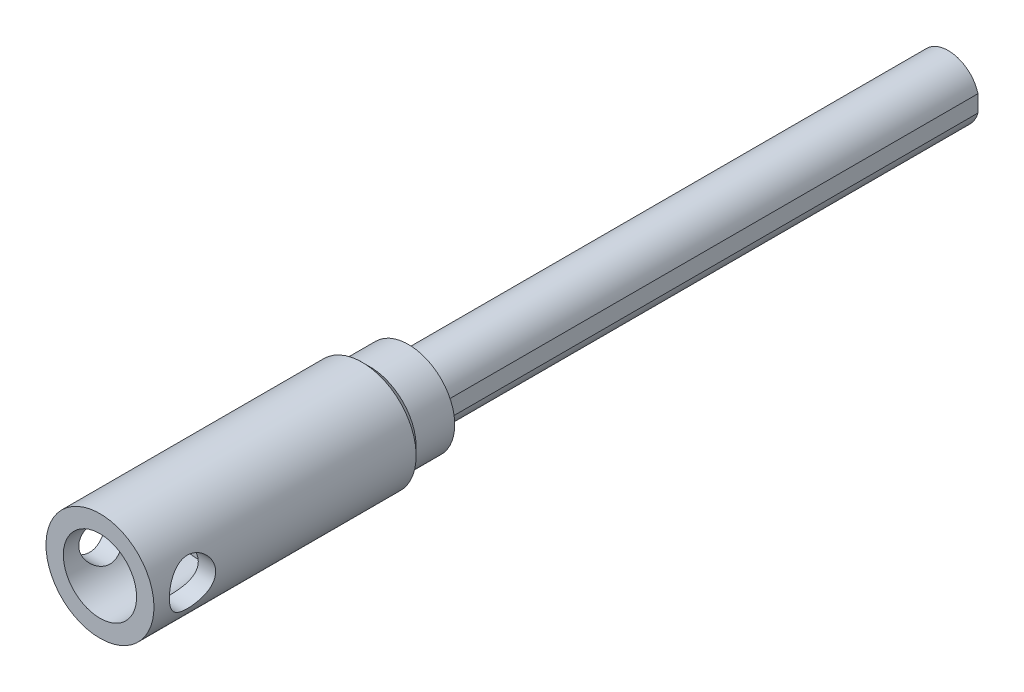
ISO-10303-21;
HEADER;
FILE_DESCRIPTION(('STEP AP214'),'2;1');
FILE_NAME('part.step','',(''),(''),'','','');
FILE_SCHEMA(('AUTOMOTIVE_DESIGN { 1 0 10303 214 1 1 1 1 }'));
ENDSEC;
DATA;
#1=APPLICATION_CONTEXT('core data for automotive mechanical design processes');
#2=APPLICATION_PROTOCOL_DEFINITION('international standard','automotive_design',2000,#1);
#3=PRODUCT_CONTEXT('',#1,'mechanical');
#4=PRODUCT('Part','Part','',(#3));
#5=PRODUCT_RELATED_PRODUCT_CATEGORY('part','',(#4));
#6=PRODUCT_DEFINITION_FORMATION('','',#4);
#7=PRODUCT_DEFINITION_CONTEXT('part definition',#1,'design');
#8=PRODUCT_DEFINITION('design','',#6,#7);
#9=PRODUCT_DEFINITION_SHAPE('','',#8);
#10=(LENGTH_UNIT() NAMED_UNIT(*) SI_UNIT(.MILLI.,.METRE.));
#11=(NAMED_UNIT(*) PLANE_ANGLE_UNIT() SI_UNIT($,.RADIAN.));
#12=(NAMED_UNIT(*) SI_UNIT($,.STERADIAN.) SOLID_ANGLE_UNIT());
#13=UNCERTAINTY_MEASURE_WITH_UNIT(LENGTH_MEASURE(1.E-05),#10,'distance_accuracy_value','');
#14=(GEOMETRIC_REPRESENTATION_CONTEXT(3) GLOBAL_UNCERTAINTY_ASSIGNED_CONTEXT((#13)) GLOBAL_UNIT_ASSIGNED_CONTEXT((#10,
#11,#12)) REPRESENTATION_CONTEXT('',''));
#15=CARTESIAN_POINT('',(0.,0.,0.));
#16=DIRECTION('',(0.,0.,1.));
#17=DIRECTION('',(1.,0.,0.));
#18=AXIS2_PLACEMENT_3D('',#15,#16,#17);
#19=CARTESIAN_POINT('',(2.3094010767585,0.,95.));
#20=DIRECTION('',(-0.866025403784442,0.5,0.));
#21=DIRECTION('',(-0.5,-0.866025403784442,0.));
#22=AXIS2_PLACEMENT_3D('',#19,#20,#21);
#23=PLANE('',#22);
#24=DIRECTION('',(0.,0.,1.));
#25=VECTOR('',#24,1.);
#26=CARTESIAN_POINT('',(1.15470053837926,-2.,95.));
#27=LINE('',#26,#25);
#28=CARTESIAN_POINT('',(1.15470053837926,-2.,95.));
#29=VERTEX_POINT('',#28);
#30=CARTESIAN_POINT('',(1.15470053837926,-2.,97.5));
#31=VERTEX_POINT('',#30);
#32=EDGE_CURVE('E273',#29,#31,#27,.T.);
#33=ORIENTED_EDGE('',*,*,#32,.T.);
#34=DIRECTION('',(-0.5,-0.866025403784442,0.));
#35=VECTOR('',#34,1.);
#36=CARTESIAN_POINT('',(2.3094010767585,0.,97.5));
#37=LINE('',#36,#35);
#38=CARTESIAN_POINT('',(2.3094010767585,0.,97.5));
#39=VERTEX_POINT('',#38);
#40=EDGE_CURVE('E29',#39,#31,#37,.T.);
#41=ORIENTED_EDGE('',*,*,#40,.F.);
#42=DIRECTION('',(0.,0.,1.));
#43=VECTOR('',#42,1.);
#44=CARTESIAN_POINT('',(2.3094010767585,0.,95.));
#45=LINE('',#44,#43);
#46=CARTESIAN_POINT('',(2.3094010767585,0.,95.));
#47=VERTEX_POINT('',#46);
#48=EDGE_CURVE('E33',#47,#39,#45,.T.);
#49=ORIENTED_EDGE('',*,*,#48,.F.);
#50=DIRECTION('',(-0.5,-0.866025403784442,0.));
#51=VECTOR('',#50,1.);
#52=CARTESIAN_POINT('',(2.3094010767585,0.,95.));
#53=LINE('',#52,#51);
#54=EDGE_CURVE('E234',#47,#29,#53,.T.);
#55=ORIENTED_EDGE('',*,*,#54,.T.);
#56=EDGE_LOOP('',(#33,#41,#49,#55));
#57=FACE_BOUND('',#56,.T.);
#58=ADVANCED_FACE('F14',(#57),#23,.T.);
#59=CARTESIAN_POINT('',(-1.15470053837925,-2.,95.));
#60=DIRECTION('',(0.,-1.,0.));
#61=DIRECTION('',(0.,0.,-1.));
#62=AXIS2_PLACEMENT_3D('',#59,#60,#61);
#63=PLANE('',#62);
#64=DIRECTION('',(0.,0.,1.));
#65=VECTOR('',#64,1.);
#66=CARTESIAN_POINT('',(-1.15470053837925,-2.,95.));
#67=LINE('',#66,#65);
#68=CARTESIAN_POINT('',(-1.15470053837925,-2.,95.));
#69=VERTEX_POINT('',#68);
#70=CARTESIAN_POINT('',(-1.15470053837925,-2.,97.5));
#71=VERTEX_POINT('',#70);
#72=EDGE_CURVE('E271',#69,#71,#67,.T.);
#73=ORIENTED_EDGE('',*,*,#72,.T.);
#74=DIRECTION('',(1.,0.,0.));
#75=VECTOR('',#74,1.);
#76=CARTESIAN_POINT('',(-1.15470053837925,-2.,97.5));
#77=LINE('',#76,#75);
#78=EDGE_CURVE('E244',#71,#31,#77,.T.);
#79=ORIENTED_EDGE('',*,*,#78,.T.);
#80=ORIENTED_EDGE('',*,*,#32,.F.);
#81=DIRECTION('',(1.,0.,0.));
#82=VECTOR('',#81,1.);
#83=CARTESIAN_POINT('',(-1.15470053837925,-2.,95.));
#84=LINE('',#83,#82);
#85=EDGE_CURVE('E260',#69,#29,#84,.T.);
#86=ORIENTED_EDGE('',*,*,#85,.F.);
#87=EDGE_LOOP('',(#73,#79,#80,#86));
#88=FACE_BOUND('',#87,.T.);
#89=ADVANCED_FACE('F164',(#88),#63,.F.);
#90=CARTESIAN_POINT('',(-2.3094010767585,0.,95.));
#91=DIRECTION('',(-0.866025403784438,-0.5,0.));
#92=DIRECTION('',(0.5,-0.866025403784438,0.));
#93=AXIS2_PLACEMENT_3D('',#90,#91,#92);
#94=PLANE('',#93);
#95=DIRECTION('',(0.,0.,1.));
#96=VECTOR('',#95,1.);
#97=CARTESIAN_POINT('',(-2.3094010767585,0.,95.));
#98=LINE('',#97,#96);
#99=CARTESIAN_POINT('',(-2.3094010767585,0.,95.));
#100=VERTEX_POINT('',#99);
#101=CARTESIAN_POINT('',(-2.3094010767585,0.,97.5));
#102=VERTEX_POINT('',#101);
#103=EDGE_CURVE('E269',#100,#102,#98,.T.);
#104=ORIENTED_EDGE('',*,*,#103,.T.);
#105=DIRECTION('',(0.5,-0.866025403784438,0.));
#106=VECTOR('',#105,1.);
#107=CARTESIAN_POINT('',(-2.3094010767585,0.,97.5));
#108=LINE('',#107,#106);
#109=EDGE_CURVE('E241',#102,#71,#108,.T.);
#110=ORIENTED_EDGE('',*,*,#109,.T.);
#111=ORIENTED_EDGE('',*,*,#72,.F.);
#112=DIRECTION('',(0.5,-0.866025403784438,0.));
#113=VECTOR('',#112,1.);
#114=CARTESIAN_POINT('',(-2.3094010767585,0.,95.));
#115=LINE('',#114,#113);
#116=EDGE_CURVE('E257',#100,#69,#115,.T.);
#117=ORIENTED_EDGE('',*,*,#116,.F.);
#118=EDGE_LOOP('',(#104,#110,#111,#117));
#119=FACE_BOUND('',#118,.T.);
#120=ADVANCED_FACE('F169',(#119),#94,.F.);
#121=CARTESIAN_POINT('',(-2.3094010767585,0.,95.));
#122=DIRECTION('',(0.866025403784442,-0.5,0.));
#123=DIRECTION('',(0.5,0.866025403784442,0.));
#124=AXIS2_PLACEMENT_3D('',#121,#122,#123);
#125=PLANE('',#124);
#126=DIRECTION('',(0.,0.,1.));
#127=VECTOR('',#126,1.);
#128=CARTESIAN_POINT('',(-1.15470053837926,2.,95.));
#129=LINE('',#128,#127);
#130=CARTESIAN_POINT('',(-1.15470053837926,2.,95.));
#131=VERTEX_POINT('',#130);
#132=CARTESIAN_POINT('',(-1.15470053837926,2.,97.5));
#133=VERTEX_POINT('',#132);
#134=EDGE_CURVE('E267',#131,#133,#129,.T.);
#135=ORIENTED_EDGE('',*,*,#134,.T.);
#136=DIRECTION('',(0.5,0.866025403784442,0.));
#137=VECTOR('',#136,1.);
#138=CARTESIAN_POINT('',(-2.3094010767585,0.,97.5));
#139=LINE('',#138,#137);
#140=EDGE_CURVE('E238',#102,#133,#139,.T.);
#141=ORIENTED_EDGE('',*,*,#140,.F.);
#142=ORIENTED_EDGE('',*,*,#103,.F.);
#143=DIRECTION('',(0.5,0.866025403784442,0.));
#144=VECTOR('',#143,1.);
#145=CARTESIAN_POINT('',(-2.3094010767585,0.,95.));
#146=LINE('',#145,#144);
#147=EDGE_CURVE('E254',#100,#131,#146,.T.);
#148=ORIENTED_EDGE('',*,*,#147,.T.);
#149=EDGE_LOOP('',(#135,#141,#142,#148));
#150=FACE_BOUND('',#149,.T.);
#151=ADVANCED_FACE('F183',(#150),#125,.T.);
#152=CARTESIAN_POINT('',(1.15470053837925,2.,95.));
#153=DIRECTION('',(0.,1.,0.));
#154=DIRECTION('',(-1.,0.,0.));
#155=AXIS2_PLACEMENT_3D('',#152,#153,#154);
#156=PLANE('',#155);
#157=DIRECTION('',(0.,0.,1.));
#158=VECTOR('',#157,1.);
#159=CARTESIAN_POINT('',(1.15470053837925,2.,95.));
#160=LINE('',#159,#158);
#161=CARTESIAN_POINT('',(1.15470053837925,2.,95.));
#162=VERTEX_POINT('',#161);
#163=CARTESIAN_POINT('',(1.15470053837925,2.,97.5));
#164=VERTEX_POINT('',#163);
#165=EDGE_CURVE('E265',#162,#164,#160,.T.);
#166=ORIENTED_EDGE('',*,*,#165,.T.);
#167=DIRECTION('',(-1.,0.,0.));
#168=VECTOR('',#167,1.);
#169=CARTESIAN_POINT('',(1.15470053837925,2.,97.5));
#170=LINE('',#169,#168);
#171=EDGE_CURVE('E235',#164,#133,#170,.T.);
#172=ORIENTED_EDGE('',*,*,#171,.T.);
#173=ORIENTED_EDGE('',*,*,#134,.F.);
#174=DIRECTION('',(-1.,0.,0.));
#175=VECTOR('',#174,1.);
#176=CARTESIAN_POINT('',(1.15470053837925,2.,95.));
#177=LINE('',#176,#175);
#178=EDGE_CURVE('E251',#162,#131,#177,.T.);
#179=ORIENTED_EDGE('',*,*,#178,.F.);
#180=EDGE_LOOP('',(#166,#172,#173,#179));
#181=FACE_BOUND('',#180,.T.);
#182=ADVANCED_FACE('F179',(#181),#156,.F.);
#183=CARTESIAN_POINT('',(2.3094010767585,0.,95.));
#184=DIRECTION('',(0.866025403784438,0.5,0.));
#185=DIRECTION('',(-0.5,0.866025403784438,0.));
#186=AXIS2_PLACEMENT_3D('',#183,#184,#185);
#187=PLANE('',#186);
#188=DIRECTION('',(-0.5,0.866025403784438,0.));
#189=VECTOR('',#188,1.);
#190=CARTESIAN_POINT('',(2.3094010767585,0.,95.));
#191=LINE('',#190,#189);
#192=EDGE_CURVE('E248',#47,#162,#191,.T.);
#193=ORIENTED_EDGE('',*,*,#192,.F.);
#194=ORIENTED_EDGE('',*,*,#48,.T.);
#195=DIRECTION('',(-0.5,0.866025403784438,0.));
#196=VECTOR('',#195,1.);
#197=CARTESIAN_POINT('',(2.3094010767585,0.,97.5));
#198=LINE('',#197,#196);
#199=EDGE_CURVE('E231',#39,#164,#198,.T.);
#200=ORIENTED_EDGE('',*,*,#199,.T.);
#201=ORIENTED_EDGE('',*,*,#165,.F.);
#202=EDGE_LOOP('',(#193,#194,#200,#201));
#203=FACE_BOUND('',#202,.T.);
#204=ADVANCED_FACE('F176',(#203),#187,.F.);
#205=CARTESIAN_POINT('',(3.46410161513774,2.,95.));
#206=DIRECTION('',(0.,0.,-1.));
#207=DIRECTION('',(0.,1.,0.));
#208=AXIS2_PLACEMENT_3D('',#205,#206,#207);
#209=PLANE('',#208);
#210=ORIENTED_EDGE('',*,*,#54,.F.);
#211=ORIENTED_EDGE('',*,*,#192,.T.);
#212=ORIENTED_EDGE('',*,*,#178,.T.);
#213=ORIENTED_EDGE('',*,*,#147,.F.);
#214=ORIENTED_EDGE('',*,*,#116,.T.);
#215=ORIENTED_EDGE('',*,*,#85,.T.);
#216=EDGE_LOOP('',(#210,#211,#212,#213,#214,#215));
#217=FACE_BOUND('',#216,.T.);
#218=ADVANCED_FACE('F174',(#217),#209,.F.);
#219=CARTESIAN_POINT('',(0.,0.,97.5));
#220=DIRECTION('',(0.,0.,1.));
#221=DIRECTION('',(0.,-1.,0.));
#222=AXIS2_PLACEMENT_3D('',#219,#220,#221);
#223=PLANE('',#222);
#224=CARTESIAN_POINT('',(0.,0.,97.5));
#225=DIRECTION('',(0.,0.,1.));
#226=DIRECTION('',(0.,-1.,0.));
#227=AXIS2_PLACEMENT_3D('',#224,#225,#226);
#228=CIRCLE('',#227,4.25);
#229=CARTESIAN_POINT('',(0.,-4.25,97.5));
#230=VERTEX_POINT('',#229);
#231=EDGE_CURVE('E9',#230,#230,#228,.T.);
#232=ORIENTED_EDGE('',*,*,#231,.T.);
#233=EDGE_LOOP('',(#232));
#234=FACE_BOUND('',#233,.T.);
#235=ORIENTED_EDGE('',*,*,#199,.F.);
#236=ORIENTED_EDGE('',*,*,#40,.T.);
#237=ORIENTED_EDGE('',*,*,#78,.F.);
#238=ORIENTED_EDGE('',*,*,#109,.F.);
#239=ORIENTED_EDGE('',*,*,#140,.T.);
#240=ORIENTED_EDGE('',*,*,#171,.F.);
#241=EDGE_LOOP('',(#235,#236,#237,#238,#239,#240));
#242=FACE_BOUND('',#241,.T.);
#243=ADVANCED_FACE('F16',(#234,#242),#223,.T.);
#244=CARTESIAN_POINT('',(0.,0.,92.5));
#245=DIRECTION('',(0.,0.,1.));
#246=DIRECTION('',(0.,-1.,0.));
#247=AXIS2_PLACEMENT_3D('',#244,#245,#246);
#248=CYLINDRICAL_SURFACE('',#247,4.25);
#249=CARTESIAN_POINT('',(0.,0.,92.5));
#250=DIRECTION('',(0.,0.,1.));
#251=DIRECTION('',(0.,-1.,0.));
#252=AXIS2_PLACEMENT_3D('',#249,#250,#251);
#253=CIRCLE('',#252,4.25);
#254=CARTESIAN_POINT('',(0.,-4.25,92.5));
#255=VERTEX_POINT('',#254);
#256=EDGE_CURVE('E22',#255,#255,#253,.T.);
#257=ORIENTED_EDGE('',*,*,#256,.T.);
#258=EDGE_LOOP('',(#257));
#259=FACE_BOUND('',#258,.T.);
#260=ORIENTED_EDGE('',*,*,#231,.F.);
#261=EDGE_LOOP('',(#260));
#262=FACE_BOUND('',#261,.T.);
#263=ADVANCED_FACE('F190',(#259,#262),#248,.T.);
#264=CARTESIAN_POINT('',(0.,0.,0.));
#265=DIRECTION('',(0.,0.,1.));
#266=DIRECTION('',(-1.,0.,0.));
#267=AXIS2_PLACEMENT_3D('',#264,#265,#266);
#268=PLANE('',#267);
#269=DIRECTION('',(0.,-1.,0.));
#270=VECTOR('',#269,1.);
#271=CARTESIAN_POINT('',(3.85,-1.08512672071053,0.));
#272=LINE('',#271,#270);
#273=CARTESIAN_POINT('',(3.85,1.08512672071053,0.));
#274=VERTEX_POINT('',#273);
#275=CARTESIAN_POINT('',(3.85,-1.08512672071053,0.));
#276=VERTEX_POINT('',#275);
#277=EDGE_CURVE('E91',#274,#276,#272,.T.);
#278=ORIENTED_EDGE('',*,*,#277,.T.);
#279=CARTESIAN_POINT('',(0.,0.,0.));
#280=DIRECTION('',(0.,0.,1.));
#281=DIRECTION('',(-1.,0.,0.));
#282=AXIS2_PLACEMENT_3D('',#279,#280,#281);
#283=CIRCLE('',#282,4.);
#284=EDGE_CURVE('E83',#274,#276,#283,.T.);
#285=ORIENTED_EDGE('',*,*,#284,.F.);
#286=EDGE_LOOP('',(#278,#285));
#287=FACE_BOUND('',#286,.T.);
#288=ADVANCED_FACE('F95',(#287),#268,.F.);
#289=CARTESIAN_POINT('',(3.85,-1.08512672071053,80.));
#290=DIRECTION('',(1.,0.,0.));
#291=DIRECTION('',(0.,0.,1.));
#292=AXIS2_PLACEMENT_3D('',#289,#290,#291);
#293=PLANE('',#292);
#294=DIRECTION('',(0.,1.,0.));
#295=VECTOR('',#294,1.);
#296=CARTESIAN_POINT('',(3.85,5.9999999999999,70.));
#297=LINE('',#296,#295);
#298=CARTESIAN_POINT('',(3.85,-1.08512672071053,70.));
#299=VERTEX_POINT('',#298);
#300=CARTESIAN_POINT('',(3.85,1.08512672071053,70.));
#301=VERTEX_POINT('',#300);
#302=EDGE_CURVE('E226',#299,#301,#297,.T.);
#303=ORIENTED_EDGE('',*,*,#302,.F.);
#304=DIRECTION('',(0.,0.,-1.));
#305=VECTOR('',#304,1.);
#306=CARTESIAN_POINT('',(3.85,-1.08512672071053,80.));
#307=LINE('',#306,#305);
#308=EDGE_CURVE('E88',#299,#276,#307,.T.);
#309=ORIENTED_EDGE('',*,*,#308,.T.);
#310=ORIENTED_EDGE('',*,*,#277,.F.);
#311=DIRECTION('',(0.,0.,-1.));
#312=VECTOR('',#311,1.);
#313=CARTESIAN_POINT('',(3.85,1.08512672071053,80.));
#314=LINE('',#313,#312);
#315=EDGE_CURVE('E78',#301,#274,#314,.T.);
#316=ORIENTED_EDGE('',*,*,#315,.F.);
#317=EDGE_LOOP('',(#303,#309,#310,#316));
#318=FACE_BOUND('',#317,.T.);
#319=ADVANCED_FACE('F92',(#318),#293,.T.);
#320=CARTESIAN_POINT('',(0.,0.,80.));
#321=DIRECTION('',(0.,0.,-1.));
#322=DIRECTION('',(1.,0.,0.));
#323=AXIS2_PLACEMENT_3D('',#320,#321,#322);
#324=CYLINDRICAL_SURFACE('',#323,4.);
#325=ORIENTED_EDGE('',*,*,#308,.F.);
#326=CARTESIAN_POINT('',(0.,0.,70.));
#327=DIRECTION('',(0.,0.,1.));
#328=DIRECTION('',(-6.15310496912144E-10,1.,0.));
#329=AXIS2_PLACEMENT_3D('',#326,#327,#328);
#330=CIRCLE('',#329,4.);
#331=EDGE_CURVE('E84',#299,#301,#330,.F.);
#332=ORIENTED_EDGE('',*,*,#331,.T.);
#333=ORIENTED_EDGE('',*,*,#315,.T.);
#334=ORIENTED_EDGE('',*,*,#284,.T.);
#335=EDGE_LOOP('',(#325,#332,#333,#334));
#336=FACE_BOUND('',#335,.T.);
#337=ADVANCED_FACE('F81',(#336),#324,.T.);
#338=CARTESIAN_POINT('',(0.,5.99999999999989,70.));
#339=DIRECTION('',(0.,0.,1.));
#340=DIRECTION('',(0.,-1.,0.));
#341=AXIS2_PLACEMENT_3D('',#338,#339,#340);
#342=PLANE('',#341);
#343=CARTESIAN_POINT('',(0.,0.,70.));
#344=DIRECTION('',(0.,0.,1.));
#345=DIRECTION('',(0.,-1.,0.));
#346=AXIS2_PLACEMENT_3D('',#343,#344,#345);
#347=CIRCLE('',#346,5.99999999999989);
#348=CARTESIAN_POINT('',(0.,-5.99999999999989,70.));
#349=VERTEX_POINT('',#348);
#350=EDGE_CURVE('E221',#349,#349,#347,.T.);
#351=ORIENTED_EDGE('',*,*,#350,.F.);
#352=EDGE_LOOP('',(#351));
#353=FACE_BOUND('',#352,.T.);
#354=ORIENTED_EDGE('',*,*,#331,.F.);
#355=ORIENTED_EDGE('',*,*,#302,.T.);
#356=EDGE_LOOP('',(#354,#355));
#357=FACE_BOUND('',#356,.T.);
#358=ADVANCED_FACE('F327',(#353,#357),#342,.F.);
#359=CARTESIAN_POINT('',(0.,0.,112.759686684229));
#360=DIRECTION('',(0.,0.,1.));
#361=DIRECTION('',(0.,-1.,0.));
#362=AXIS2_PLACEMENT_3D('',#359,#360,#361);
#363=CYLINDRICAL_SURFACE('',#362,5.99999999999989);
#364=CARTESIAN_POINT('',(0.,0.,75.));
#365=DIRECTION('',(0.,0.,1.));
#366=DIRECTION('',(0.,-1.,0.));
#367=AXIS2_PLACEMENT_3D('',#364,#365,#366);
#368=CIRCLE('',#367,5.99999999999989);
#369=CARTESIAN_POINT('',(0.,-5.99999999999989,75.));
#370=VERTEX_POINT('',#369);
#371=EDGE_CURVE('E219',#370,#370,#368,.T.);
#372=ORIENTED_EDGE('',*,*,#371,.F.);
#373=EDGE_LOOP('',(#372));
#374=FACE_BOUND('',#373,.T.);
#375=ORIENTED_EDGE('',*,*,#350,.T.);
#376=EDGE_LOOP('',(#375));
#377=FACE_BOUND('',#376,.T.);
#378=ADVANCED_FACE('F335',(#374,#377),#363,.T.);
#379=CARTESIAN_POINT('',(0.,0.,76.));
#380=DIRECTION('',(0.,0.,1.));
#381=DIRECTION('',(0.,-1.,0.));
#382=AXIS2_PLACEMENT_3D('',#379,#380,#381);
#383=CONICAL_SURFACE('',#382,7.0000000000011,0.78539816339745);
#384=ORIENTED_EDGE('',*,*,#371,.T.);
#385=EDGE_LOOP('',(#384));
#386=FACE_BOUND('',#385,.T.);
#387=CARTESIAN_POINT('',(0.,0.,76.));
#388=DIRECTION('',(0.,0.,1.));
#389=DIRECTION('',(0.,-1.,0.));
#390=AXIS2_PLACEMENT_3D('',#387,#388,#389);
#391=CIRCLE('',#390,7.0000000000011);
#392=CARTESIAN_POINT('',(0.,-7.0000000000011,76.));
#393=VERTEX_POINT('',#392);
#394=EDGE_CURVE('E145',#393,#393,#391,.T.);
#395=ORIENTED_EDGE('',*,*,#394,.F.);
#396=EDGE_LOOP('',(#395));
#397=FACE_BOUND('',#396,.T.);
#398=ADVANCED_FACE('F128',(#386,#397),#383,.T.);
#399=CARTESIAN_POINT('',(0.,0.,112.759686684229));
#400=DIRECTION('',(0.,0.,1.));
#401=DIRECTION('',(0.,-1.,0.));
#402=AXIS2_PLACEMENT_3D('',#399,#400,#401);
#403=CYLINDRICAL_SURFACE('',#402,7.0000000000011);
#404=ORIENTED_EDGE('',*,*,#394,.T.);
#405=EDGE_LOOP('',(#404));
#406=FACE_BOUND('',#405,.T.);
#407=CARTESIAN_POINT('',(-7.0000000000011,1.09818090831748E-12,108.));
#408=CARTESIAN_POINT('',(-6.99999408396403,-0.160281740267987,107.999992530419));
#409=CARTESIAN_POINT('',(-6.9944325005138,-0.320833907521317,107.987078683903));
#410=CARTESIAN_POINT('',(-6.97273920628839,-0.637349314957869,107.935917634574));
#411=CARTESIAN_POINT('',(-6.95658080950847,-0.793299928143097,107.897606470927));
#412=CARTESIAN_POINT('',(-6.91541630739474,-1.09553470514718,107.797330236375));
#413=CARTESIAN_POINT('',(-6.89044089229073,-1.24185033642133,107.735447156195));
#414=CARTESIAN_POINT('',(-6.83405660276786,-1.52187332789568,107.590135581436));
#415=CARTESIAN_POINT('',(-6.80264947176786,-1.65558409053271,107.506712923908));
#416=CARTESIAN_POINT('',(-6.73467821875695,-1.91384144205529,107.316072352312));
#417=CARTESIAN_POINT('',(-6.6979389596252,-2.03764045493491,107.207904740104));
#418=CARTESIAN_POINT('',(-6.62417654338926,-2.26599040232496,106.972856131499));
#419=CARTESIAN_POINT('',(-6.58715324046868,-2.37053065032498,106.845964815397));
#420=CARTESIAN_POINT('',(-6.51482055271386,-2.56285686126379,106.568967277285));
#421=CARTESIAN_POINT('',(-6.4797046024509,-2.64946811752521,106.417989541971));
#422=CARTESIAN_POINT('',(-6.41796168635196,-2.79573199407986,106.101890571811));
#423=CARTESIAN_POINT('',(-6.39133010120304,-2.85539929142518,105.936777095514));
#424=CARTESIAN_POINT('',(-6.35147799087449,-2.94294919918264,105.605699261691));
#425=CARTESIAN_POINT('',(-6.33765221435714,-2.97227494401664,105.440192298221));
#426=CARTESIAN_POINT('',(-6.32324849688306,-3.00280607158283,105.10607403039));
#427=CARTESIAN_POINT('',(-6.32266262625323,-3.00402828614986,104.937464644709));
#428=CARTESIAN_POINT('',(-6.33429573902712,-2.97939999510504,104.616700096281));
#429=CARTESIAN_POINT('',(-6.3454687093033,-2.95576113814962,104.464329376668));
#430=CARTESIAN_POINT('',(-6.37758411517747,-2.88580772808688,104.165972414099));
#431=CARTESIAN_POINT('',(-6.39852855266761,-2.83948852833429,104.019987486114));
#432=CARTESIAN_POINT('',(-6.44830685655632,-2.72457659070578,103.734752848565));
#433=CARTESIAN_POINT('',(-6.47730295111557,-2.65551974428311,103.595719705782));
#434=CARTESIAN_POINT('',(-6.53988493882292,-2.49742304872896,103.33065367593));
#435=CARTESIAN_POINT('',(-6.57347269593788,-2.40837507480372,103.20462610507));
#436=CARTESIAN_POINT('',(-6.64512404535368,-2.2034340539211,102.957222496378));
#437=CARTESIAN_POINT('',(-6.68331855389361,-2.08584728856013,102.837283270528));
#438=CARTESIAN_POINT('',(-6.7573460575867,-1.83187332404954,102.618328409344));
#439=CARTESIAN_POINT('',(-6.79317843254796,-1.69548121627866,102.519318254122));
#440=CARTESIAN_POINT('',(-6.85959693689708,-1.40318582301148,102.342756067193));
#441=CARTESIAN_POINT('',(-6.89002455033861,-1.24687114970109,102.265820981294));
#442=CARTESIAN_POINT('',(-6.94097396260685,-0.921879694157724,102.139849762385));
#443=CARTESIAN_POINT('',(-6.96150156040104,-0.753210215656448,102.090797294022));
#444=CARTESIAN_POINT('',(-6.98923526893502,-0.420276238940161,102.025066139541));
#445=CARTESIAN_POINT('',(-6.99723249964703,-0.256457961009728,102.006461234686));
#446=CARTESIAN_POINT('',(-7.00155416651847,0.0721433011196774,101.996370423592));
#447=CARTESIAN_POINT('',(-6.99788220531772,0.236925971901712,102.004876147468));
#448=CARTESIAN_POINT('',(-6.97978676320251,0.553542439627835,102.047415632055));
#449=CARTESIAN_POINT('',(-6.96594519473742,0.7055989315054,102.080068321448));
#450=CARTESIAN_POINT('',(-6.92953888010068,1.0018911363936,102.168020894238));
#451=CARTESIAN_POINT('',(-6.90697304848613,1.14612587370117,102.223323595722));
#452=CARTESIAN_POINT('',(-6.85438751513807,1.42777696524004,102.356801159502));
#453=CARTESIAN_POINT('',(-6.8241570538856,1.56483974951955,102.435636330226));
#454=CARTESIAN_POINT('',(-6.7594298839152,1.82428490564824,102.613218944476));
#455=CARTESIAN_POINT('',(-6.72493135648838,1.9466609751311,102.711974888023));
#456=CARTESIAN_POINT('',(-6.6521478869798,2.18296759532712,102.935289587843));
#457=CARTESIAN_POINT('',(-6.61377354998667,2.29556617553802,103.061232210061));
#458=CARTESIAN_POINT('',(-6.53984037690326,2.49843431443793,103.330782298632));
#459=CARTESIAN_POINT('',(-6.50428232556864,2.58869766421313,103.474394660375));
#460=CARTESIAN_POINT('',(-6.43962969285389,2.74563875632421,103.778813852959));
#461=CARTESIAN_POINT('',(-6.41066255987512,2.8118641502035,103.93988300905));
#462=CARTESIAN_POINT('',(-6.36413607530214,2.91565885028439,104.27252632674));
#463=CARTESIAN_POINT('',(-6.34656658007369,2.95325364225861,104.444090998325));
#464=CARTESIAN_POINT('',(-6.32643481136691,2.9961194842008,104.777991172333));
#465=CARTESIAN_POINT('',(-6.3227792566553,3.00374693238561,104.939959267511));
#466=CARTESIAN_POINT('',(-6.32795618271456,2.99282649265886,105.262789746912));
#467=CARTESIAN_POINT('',(-6.33678646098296,2.97428322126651,105.423652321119));
#468=CARTESIAN_POINT('',(-6.36491653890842,2.91356431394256,105.731041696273));
#469=CARTESIAN_POINT('',(-6.38364713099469,2.87266975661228,105.877878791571));
#470=CARTESIAN_POINT('',(-6.42898875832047,2.76970222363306,106.162620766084));
#471=CARTESIAN_POINT('',(-6.45560203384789,2.70762322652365,106.300523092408));
#472=CARTESIAN_POINT('',(-6.51575247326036,2.55963250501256,106.57282070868));
#473=CARTESIAN_POINT('',(-6.54961649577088,2.47248232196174,106.706469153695));
#474=CARTESIAN_POINT('',(-6.61959778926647,2.27849600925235,106.957982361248));
#475=CARTESIAN_POINT('',(-6.65571590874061,2.17165243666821,107.075841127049));
#476=CARTESIAN_POINT('',(-6.72955424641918,1.93135048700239,107.302003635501));
#477=CARTESIAN_POINT('',(-6.76717599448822,1.79645724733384,107.408819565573));
#478=CARTESIAN_POINT('',(-6.83696477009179,1.50919760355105,107.598439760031));
#479=CARTESIAN_POINT('',(-6.86912932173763,1.35682332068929,107.6812331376));
#480=CARTESIAN_POINT('',(-6.91035442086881,1.11954532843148,107.78459269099));
#481=CARTESIAN_POINT('',(-6.92286397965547,1.03957288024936,107.815433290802));
#482=CARTESIAN_POINT('',(-6.94533202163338,0.876970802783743,107.870238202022));
#483=CARTESIAN_POINT('',(-6.9552917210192,0.794342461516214,107.894205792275));
#484=CARTESIAN_POINT('',(-6.97234378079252,0.627265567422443,107.934947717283));
#485=CARTESIAN_POINT('',(-6.97944312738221,0.54282198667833,107.951739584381));
#486=CARTESIAN_POINT('',(-6.99059319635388,0.372647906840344,107.978008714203));
#487=CARTESIAN_POINT('',(-6.99464610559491,0.286918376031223,107.987491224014));
#488=CARTESIAN_POINT('',(-6.99807592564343,0.167492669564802,107.995508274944));
#489=CARTESIAN_POINT('',(-6.9987967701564,0.134021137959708,107.997191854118));
#490=CARTESIAN_POINT('',(-6.9997594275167,0.0670370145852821,107.999438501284));
#491=CARTESIAN_POINT('',(-7.00000123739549,0.0335244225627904,108.000001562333));
#492=CARTESIAN_POINT('',(-7.0000000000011,1.09818090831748E-12,108.));
#493=B_SPLINE_CURVE_WITH_KNOTS('',3,(#407,#408,#409,#410,#411,#412,#413,#414,#415,#416,#417,
#418,#419,#420,#421,#422,#423,#424,#425,#426,#427,#428,#429,#430,#431,#432,#433,#434,#435,#436,
#437,#438,#439,#440,#441,#442,#443,#444,#445,#446,#447,#448,#449,#450,#451,#452,#453,#454,#455,
#456,#457,#458,#459,#460,#461,#462,#463,#464,#465,#466,#467,#468,#469,#470,#471,#472,#473,#474,
#475,#476,#477,#478,#479,#480,#481,#482,#483,#484,#485,#486,#487,#488,#489,#490,#491,#492),
.UNSPECIFIED.,.T.,.F.,(4,2,2,2,2,2,2,2,2,2,2,2,2,2,2,2,2,2,2,2,2,2,2,2,2,2,2,2,2,2,2,2,2,2,2,2,
2,2,2,2,2,2,4),(0.,0.480714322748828,0.962643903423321,1.44291226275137,1.92305060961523,
2.42622743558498,2.92968263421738,3.45969560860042,3.98941952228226,4.49259426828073,
4.99546764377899,5.4571072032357,5.91884138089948,6.39065408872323,6.86265889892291,
7.37709837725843,7.89167239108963,8.4194724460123,8.94696296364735,9.43957347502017,
9.93203191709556,10.3983119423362,10.8646499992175,11.345550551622,11.8266567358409,
12.3440285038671,12.8615439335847,13.3883469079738,13.9146803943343,14.3986848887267,
14.882604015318,15.341320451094,15.8001673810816,16.2874475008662,16.7749121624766,
17.3008416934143,17.8270092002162,18.0865840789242,18.34603491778,18.6048481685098,
18.8634754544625,18.9640207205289,19.0645666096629),.UNSPECIFIED.);
#494=CARTESIAN_POINT('',(-7.0000000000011,1.09818090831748E-12,108.));
#495=VERTEX_POINT('',#494);
#496=EDGE_CURVE('E111',#495,#495,#493,.T.);
#497=ORIENTED_EDGE('',*,*,#496,.T.);
#498=EDGE_LOOP('',(#497));
#499=FACE_BOUND('',#498,.T.);
#500=CARTESIAN_POINT('',(7.0000000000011,1.1500207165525E-12,108.));
#501=CARTESIAN_POINT('',(6.99999408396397,0.160281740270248,107.999992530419));
#502=CARTESIAN_POINT('',(6.9944325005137,0.32083390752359,107.987078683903));
#503=CARTESIAN_POINT('',(6.97273920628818,0.637349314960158,107.935917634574));
#504=CARTESIAN_POINT('',(6.95658080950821,0.79329992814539,107.897606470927));
#505=CARTESIAN_POINT('',(6.91541630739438,1.0955347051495,107.797330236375));
#506=CARTESIAN_POINT('',(6.8904408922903,1.24185033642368,107.735447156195));
#507=CARTESIAN_POINT('',(6.83405660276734,1.52187332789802,107.590135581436));
#508=CARTESIAN_POINT('',(6.80264947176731,1.65558409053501,107.506712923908));
#509=CARTESIAN_POINT('',(6.7346782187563,1.91384144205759,107.316072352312));
#510=CARTESIAN_POINT('',(6.69793895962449,2.03764045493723,107.207904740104));
#511=CARTESIAN_POINT('',(6.62417654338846,2.26599040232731,106.972856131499));
#512=CARTESIAN_POINT('',(6.58715324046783,2.37053065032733,106.845964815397));
#513=CARTESIAN_POINT('',(6.51482055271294,2.56285686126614,106.568967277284));
#514=CARTESIAN_POINT('',(6.47970460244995,2.64946811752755,106.417989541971));
#515=CARTESIAN_POINT('',(6.41796168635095,2.79573199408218,106.101890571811));
#516=CARTESIAN_POINT('',(6.39133010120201,2.85539929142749,105.936777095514));
#517=CARTESIAN_POINT('',(6.35147799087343,2.94294919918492,105.605699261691));
#518=CARTESIAN_POINT('',(6.33765221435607,2.97227494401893,105.44019229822));
#519=CARTESIAN_POINT('',(6.32324849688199,3.00280607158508,105.10607403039));
#520=CARTESIAN_POINT('',(6.32266262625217,3.00402828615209,104.937464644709));
#521=CARTESIAN_POINT('',(6.33429573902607,2.97939999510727,104.616700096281));
#522=CARTESIAN_POINT('',(6.34546870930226,2.95576113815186,104.464329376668));
#523=CARTESIAN_POINT('',(6.37758411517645,2.88580772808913,104.165972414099));
#524=CARTESIAN_POINT('',(6.39852855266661,2.83948852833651,104.019987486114));
#525=CARTESIAN_POINT('',(6.44830685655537,2.72457659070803,103.734752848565));
#526=CARTESIAN_POINT('',(6.47730295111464,2.65551974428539,103.595719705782));
#527=CARTESIAN_POINT('',(6.53988493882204,2.49742304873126,103.330653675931));
#528=CARTESIAN_POINT('',(6.57347269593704,2.408375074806,103.204626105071));
#529=CARTESIAN_POINT('',(6.64512404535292,2.20343405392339,102.957222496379));
#530=CARTESIAN_POINT('',(6.68331855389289,2.08584728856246,102.837283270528));
#531=CARTESIAN_POINT('',(6.75734605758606,1.8318733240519,102.618328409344));
#532=CARTESIAN_POINT('',(6.79317843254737,1.69548121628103,102.519318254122));
#533=CARTESIAN_POINT('',(6.85959693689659,1.40318582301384,102.342756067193));
#534=CARTESIAN_POINT('',(6.89002455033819,1.24687114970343,102.265820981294));
#535=CARTESIAN_POINT('',(6.94097396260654,0.921879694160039,102.139849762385));
#536=CARTESIAN_POINT('',(6.96150156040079,0.75321021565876,102.090797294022));
#537=CARTESIAN_POINT('',(6.98923526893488,0.420276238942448,102.025066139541));
#538=CARTESIAN_POINT('',(6.99723249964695,0.256457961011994,102.006461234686));
#539=CARTESIAN_POINT('',(7.0015541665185,-0.0721433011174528,101.996370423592));
#540=CARTESIAN_POINT('',(6.9978822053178,-0.236925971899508,102.004876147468));
#541=CARTESIAN_POINT('',(6.97978676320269,-0.55354243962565,102.047415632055));
#542=CARTESIAN_POINT('',(6.96594519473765,-0.705598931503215,102.080068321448));
#543=CARTESIAN_POINT('',(6.929538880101,-1.00189113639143,102.168020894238));
#544=CARTESIAN_POINT('',(6.90697304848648,-1.14612587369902,102.223323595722));
#545=CARTESIAN_POINT('',(6.85438751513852,-1.42777696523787,102.356801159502));
#546=CARTESIAN_POINT('',(6.8241570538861,-1.56483974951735,102.435636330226));
#547=CARTESIAN_POINT('',(6.7594298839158,-1.82428490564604,102.613218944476));
#548=CARTESIAN_POINT('',(6.72493135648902,-1.94666097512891,102.711974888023));
#549=CARTESIAN_POINT('',(6.65214788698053,-2.18296759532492,102.935289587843));
#550=CARTESIAN_POINT('',(6.61377354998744,-2.2955661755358,103.061232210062));
#551=CARTESIAN_POINT('',(6.53984037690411,-2.49843431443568,103.330782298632));
#552=CARTESIAN_POINT('',(6.50428232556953,-2.58869766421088,103.474394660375));
#553=CARTESIAN_POINT('',(6.43962969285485,-2.74563875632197,103.778813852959));
#554=CARTESIAN_POINT('',(6.41066255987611,-2.81186415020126,103.93988300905));
#555=CARTESIAN_POINT('',(6.36413607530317,-2.91565885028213,104.27252632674));
#556=CARTESIAN_POINT('',(6.34656658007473,-2.95325364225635,104.444090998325));
#557=CARTESIAN_POINT('',(6.32643481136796,-2.99611948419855,104.777991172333));
#558=CARTESIAN_POINT('',(6.32277925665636,-3.00374693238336,104.939959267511));
#559=CARTESIAN_POINT('',(6.32795618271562,-2.99282649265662,105.262789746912));
#560=CARTESIAN_POINT('',(6.33678646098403,-2.97428322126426,105.423652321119));
#561=CARTESIAN_POINT('',(6.36491653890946,-2.9135643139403,105.731041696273));
#562=CARTESIAN_POINT('',(6.38364713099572,-2.87266975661,105.877878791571));
#563=CARTESIAN_POINT('',(6.42898875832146,-2.76970222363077,106.162620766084));
#564=CARTESIAN_POINT('',(6.45560203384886,-2.70762322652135,106.300523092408));
#565=CARTESIAN_POINT('',(6.51575247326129,-2.55963250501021,106.57282070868));
#566=CARTESIAN_POINT('',(6.54961649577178,-2.47248232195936,106.706469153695));
#567=CARTESIAN_POINT('',(6.6195977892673,-2.27849600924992,106.957982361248));
#568=CARTESIAN_POINT('',(6.6557159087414,-2.17165243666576,107.075841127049));
#569=CARTESIAN_POINT('',(6.72955424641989,-1.9313504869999,107.302003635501));
#570=CARTESIAN_POINT('',(6.76717599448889,-1.79645724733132,107.408819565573));
#571=CARTESIAN_POINT('',(6.83696477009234,-1.50919760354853,107.598439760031));
#572=CARTESIAN_POINT('',(6.86912932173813,-1.35682332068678,107.6812331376));
#573=CARTESIAN_POINT('',(6.91035442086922,-1.11954532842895,107.78459269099));
#574=CARTESIAN_POINT('',(6.92286397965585,-1.03957288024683,107.815433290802));
#575=CARTESIAN_POINT('',(6.9453320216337,-0.876970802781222,107.870238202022));
#576=CARTESIAN_POINT('',(6.95529172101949,-0.794342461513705,107.894205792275));
#577=CARTESIAN_POINT('',(6.97234378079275,-0.627265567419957,107.934947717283));
#578=CARTESIAN_POINT('',(6.9794431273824,-0.542821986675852,107.951739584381));
#579=CARTESIAN_POINT('',(6.99059319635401,-0.372647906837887,107.978008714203));
#580=CARTESIAN_POINT('',(6.99464610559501,-0.286918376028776,107.987491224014));
#581=CARTESIAN_POINT('',(6.99807592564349,-0.167492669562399,107.995508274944));
#582=CARTESIAN_POINT('',(6.99879677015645,-0.134021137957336,107.997191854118));
#583=CARTESIAN_POINT('',(6.99975942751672,-0.0670370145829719,107.999438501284));
#584=CARTESIAN_POINT('',(7.0000012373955,-0.0335244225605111,108.000001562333));
#585=CARTESIAN_POINT('',(7.0000000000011,1.1500207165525E-12,108.));
#586=B_SPLINE_CURVE_WITH_KNOTS('',3,(#500,#501,#502,#503,#504,#505,#506,#507,#508,#509,#510,
#511,#512,#513,#514,#515,#516,#517,#518,#519,#520,#521,#522,#523,#524,#525,#526,#527,#528,#529,
#530,#531,#532,#533,#534,#535,#536,#537,#538,#539,#540,#541,#542,#543,#544,#545,#546,#547,#548,
#549,#550,#551,#552,#553,#554,#555,#556,#557,#558,#559,#560,#561,#562,#563,#564,#565,#566,#567,
#568,#569,#570,#571,#572,#573,#574,#575,#576,#577,#578,#579,#580,#581,#582,#583,#584,#585),
.UNSPECIFIED.,.T.,.F.,(4,2,2,2,2,2,2,2,2,2,2,2,2,2,2,2,2,2,2,2,2,2,2,2,2,2,2,2,2,2,2,2,2,2,2,2,
2,2,2,2,2,2,4),(0.,0.480714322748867,0.962643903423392,1.44291226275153,1.92305060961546,
2.4262274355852,2.92968263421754,3.45969560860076,3.98941952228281,4.4925942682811,
4.99546764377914,5.45710720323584,5.91884138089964,6.3906540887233,6.86265889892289,
7.37709837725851,7.89167239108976,8.41947244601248,8.94696296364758,9.43957347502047,
9.93203191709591,10.3983119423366,10.8646499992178,11.3455505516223,11.8266567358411,
12.3440285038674,12.8615439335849,13.388346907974,13.9146803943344,14.3986848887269,
14.8826040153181,15.3413204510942,15.800167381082,16.2874475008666,16.774912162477,
17.3008416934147,17.8270092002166,18.0865840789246,18.3460349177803,18.60484816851,
18.8634754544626,18.964020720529,19.0645666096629),.UNSPECIFIED.);
#587=CARTESIAN_POINT('',(7.0000000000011,1.1500207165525E-12,108.));
#588=VERTEX_POINT('',#587);
#589=EDGE_CURVE('E103',#588,#588,#586,.T.);
#590=ORIENTED_EDGE('',*,*,#589,.T.);
#591=EDGE_LOOP('',(#590));
#592=FACE_BOUND('',#591,.T.);
#593=CARTESIAN_POINT('',(0.,0.,110.));
#594=DIRECTION('',(0.,0.,1.));
#595=DIRECTION('',(0.,-1.,0.));
#596=AXIS2_PLACEMENT_3D('',#593,#594,#595);
#597=CIRCLE('',#596,7.00000000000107);
#598=CARTESIAN_POINT('',(0.,-7.00000000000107,110.));
#599=VERTEX_POINT('',#598);
#600=EDGE_CURVE('E213',#599,#599,#597,.T.);
#601=ORIENTED_EDGE('',*,*,#600,.F.);
#602=EDGE_LOOP('',(#601));
#603=FACE_BOUND('',#602,.T.);
#604=ADVANCED_FACE('F116',(#406,#499,#592,#603),#403,.T.);
#605=CARTESIAN_POINT('',(0.,7.00000000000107,110.));
#606=DIRECTION('',(0.,0.,-1.));
#607=DIRECTION('',(0.,1.,0.));
#608=AXIS2_PLACEMENT_3D('',#605,#606,#607);
#609=PLANE('',#608);
#610=CARTESIAN_POINT('',(0.,0.,110.));
#611=DIRECTION('',(0.,0.,1.));
#612=DIRECTION('',(0.,-1.,0.));
#613=AXIS2_PLACEMENT_3D('',#610,#611,#612);
#614=CIRCLE('',#613,4.75);
#615=CARTESIAN_POINT('',(0.,-4.75,110.));
#616=VERTEX_POINT('',#615);
#617=EDGE_CURVE('E211',#616,#616,#614,.T.);
#618=ORIENTED_EDGE('',*,*,#617,.F.);
#619=EDGE_LOOP('',(#618));
#620=FACE_BOUND('',#619,.T.);
#621=ORIENTED_EDGE('',*,*,#600,.T.);
#622=EDGE_LOOP('',(#621));
#623=FACE_BOUND('',#622,.T.);
#624=ADVANCED_FACE('F150',(#620,#623),#609,.F.);
#625=CARTESIAN_POINT('',(-15.,1.06855816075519E-12,105.));
#626=DIRECTION('',(1.,0.,0.));
#627=DIRECTION('',(0.,0.,1.));
#628=AXIS2_PLACEMENT_3D('',#625,#626,#627);
#629=CYLINDRICAL_SURFACE('',#628,3.);
#630=CARTESIAN_POINT('',(4.75,1.14168931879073E-12,108.));
#631=CARTESIAN_POINT('',(4.74999955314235,-0.0761103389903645,107.999999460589));
#632=CARTESIAN_POINT('',(4.74816499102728,-0.152222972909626,107.997097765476));
#633=CARTESIAN_POINT('',(4.74088144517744,-0.30384472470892,107.985543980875));
#634=CARTESIAN_POINT('',(4.73543103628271,-0.379353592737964,107.976889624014));
#635=CARTESIAN_POINT('',(4.71380589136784,-0.604265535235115,107.942416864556));
#636=CARTESIAN_POINT('',(4.69235743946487,-0.751968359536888,107.908088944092));
#637=CARTESIAN_POINT('',(4.63755605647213,-1.03764440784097,107.818802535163));
#638=CARTESIAN_POINT('',(4.60426199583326,-1.1756617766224,107.76394600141));
#639=CARTESIAN_POINT('',(4.52853238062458,-1.44007270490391,107.63586261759));
#640=CARTESIAN_POINT('',(4.48609752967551,-1.56646715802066,107.562637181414));
#641=CARTESIAN_POINT('',(4.39152281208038,-1.81553885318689,107.393386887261));
#642=CARTESIAN_POINT('',(4.33887608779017,-1.93709280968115,107.295998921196));
#643=CARTESIAN_POINT('',(4.23068324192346,-2.16323071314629,107.084337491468));
#644=CARTESIAN_POINT('',(4.17513324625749,-2.26779117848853,106.970041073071));
#645=CARTESIAN_POINT('',(4.0581440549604,-2.4717626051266,106.709238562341));
#646=CARTESIAN_POINT('',(3.99695850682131,-2.5684412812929,106.560463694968));
#647=CARTESIAN_POINT('',(3.8847799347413,-2.73516117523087,106.24520937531));
#648=CARTESIAN_POINT('',(3.83376964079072,-2.80524771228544,106.07876066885));
#649=CARTESIAN_POINT('',(3.76186029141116,-2.90060198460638,105.777469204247));
#650=CARTESIAN_POINT('',(3.73656719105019,-2.93281686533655,105.645881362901));
#651=CARTESIAN_POINT('',(3.6996852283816,-2.97921746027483,105.377764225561));
#652=CARTESIAN_POINT('',(3.68807636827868,-2.99342948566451,105.241242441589));
#653=CARTESIAN_POINT('',(3.68031818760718,-3.00296624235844,104.9666960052));
#654=CARTESIAN_POINT('',(3.68421247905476,-2.99823769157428,104.828668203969));
#655=CARTESIAN_POINT('',(3.70692728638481,-2.97009984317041,104.55574498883));
#656=CARTESIAN_POINT('',(3.72575992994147,-2.9466753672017,104.420852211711));
#657=CARTESIAN_POINT('',(3.77495885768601,-2.88335211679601,104.161124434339));
#658=CARTESIAN_POINT('',(3.8050150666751,-2.84389393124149,104.036119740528));
#659=CARTESIAN_POINT('',(3.87334508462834,-2.75010154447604,103.794268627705));
#660=CARTESIAN_POINT('',(3.91162177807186,-2.69576211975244,103.677425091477));
#661=CARTESIAN_POINT('',(4.00084802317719,-2.56189972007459,103.431626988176));
#662=CARTESIAN_POINT('',(4.05282406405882,-2.47955458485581,103.304581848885));
#663=CARTESIAN_POINT('',(4.1588740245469,-2.29726597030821,103.064717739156));
#664=CARTESIAN_POINT('',(4.21295008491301,-2.19730414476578,102.951913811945));
#665=CARTESIAN_POINT('',(4.32806963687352,-1.96218966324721,102.723821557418));
#666=CARTESIAN_POINT('',(4.38870849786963,-1.82394123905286,102.611453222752));
#667=CARTESIAN_POINT('',(4.4725891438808,-1.60149131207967,102.461645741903));
#668=CARTESIAN_POINT('',(4.49938196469,-1.52478418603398,102.414814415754));
#669=CARTESIAN_POINT('',(4.54988768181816,-1.36670658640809,102.327878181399));
#670=CARTESIAN_POINT('',(4.57360246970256,-1.28533902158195,102.287769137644));
#671=CARTESIAN_POINT('',(4.61615250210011,-1.12265227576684,102.216632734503));
#672=CARTESIAN_POINT('',(4.63517339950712,-1.04153722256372,102.185249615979));
#673=CARTESIAN_POINT('',(4.66925448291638,-0.876175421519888,102.129473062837));
#674=CARTESIAN_POINT('',(4.68431697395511,-0.791930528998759,102.105075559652));
#675=CARTESIAN_POINT('',(4.71001494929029,-0.621054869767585,102.063674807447));
#676=CARTESIAN_POINT('',(4.72065460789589,-0.534426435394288,102.046664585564));
#677=CARTESIAN_POINT('',(4.73718438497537,-0.359599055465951,102.020316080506));
#678=CARTESIAN_POINT('',(4.74307535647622,-0.271400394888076,102.01097641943));
#679=CARTESIAN_POINT('',(4.7522513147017,-0.0326976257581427,101.99642280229));
#680=CARTESIAN_POINT('',(4.75088387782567,0.118530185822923,101.998580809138));
#681=CARTESIAN_POINT('',(4.73395075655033,0.418044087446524,102.025460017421));
#682=CARTESIAN_POINT('',(4.71838626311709,0.566330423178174,102.050179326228));
#683=CARTESIAN_POINT('',(4.67552722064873,0.849447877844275,102.119245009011));
#684=CARTESIAN_POINT('',(4.64877142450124,0.984583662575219,102.162692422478));
#685=CARTESIAN_POINT('',(4.58577545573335,1.24547102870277,102.267131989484));
#686=CARTESIAN_POINT('',(4.54953375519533,1.3712210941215,102.328126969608));
#687=CARTESIAN_POINT('',(4.46613742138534,1.62341278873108,102.472607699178));
#688=CARTESIAN_POINT('',(4.41825478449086,1.74867187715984,102.557730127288));
#689=CARTESIAN_POINT('',(4.31772247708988,1.98398151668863,102.744685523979));
#690=CARTESIAN_POINT('',(4.26506765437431,2.09401529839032,102.846536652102));
#691=CARTESIAN_POINT('',(4.1510303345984,2.31274988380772,103.0814959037));
#692=CARTESIAN_POINT('',(4.08951437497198,2.41881916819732,103.216999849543));
#693=CARTESIAN_POINT('',(3.97209647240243,2.60715641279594,103.5058719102));
#694=CARTESIAN_POINT('',(3.91619127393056,2.68943822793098,103.65922955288));
#695=CARTESIAN_POINT('',(3.82802189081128,2.81305697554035,103.948311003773));
#696=CARTESIAN_POINT('',(3.79325987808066,2.85933888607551,104.081146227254));
#697=CARTESIAN_POINT('',(3.73649984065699,2.93313195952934,104.354474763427));
#698=CARTESIAN_POINT('',(3.71448145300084,2.96067308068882,104.494955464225));
#699=CARTESIAN_POINT('',(3.68648301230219,2.9954771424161,104.780976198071));
#700=CARTESIAN_POINT('',(3.68060419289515,3.00261209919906,104.926542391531));
#701=CARTESIAN_POINT('',(3.68625143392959,2.9956741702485,105.216851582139));
#702=CARTESIAN_POINT('',(3.69778179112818,2.98159604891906,105.361594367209));
#703=CARTESIAN_POINT('',(3.73447050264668,2.93546767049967,105.632646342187));
#704=CARTESIAN_POINT('',(3.75831222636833,2.9051446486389,105.759443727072));
#705=CARTESIAN_POINT('',(3.8157782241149,2.82923882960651,106.006015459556));
#706=CARTESIAN_POINT('',(3.84940678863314,2.78364933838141,106.125786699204));
#707=CARTESIAN_POINT('',(3.92842329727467,2.6712050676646,106.373190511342));
#708=CARTESIAN_POINT('',(3.97480082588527,2.6022579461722,106.49954943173));
#709=CARTESIAN_POINT('',(4.07165396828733,2.4479465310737,106.740116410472));
#710=CARTESIAN_POINT('',(4.12213279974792,2.36256927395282,106.854314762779));
#711=CARTESIAN_POINT('',(4.23378589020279,2.15728721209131,107.091793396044));
#712=CARTESIAN_POINT('',(4.29500972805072,2.03389364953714,107.212055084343));
#713=CARTESIAN_POINT('',(4.41173300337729,1.76645251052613,107.430936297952));
#714=CARTESIAN_POINT('',(4.46722843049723,1.62239063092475,107.529540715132));
#715=CARTESIAN_POINT('',(4.54217395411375,1.39205715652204,107.658962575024));
#716=CARTESIAN_POINT('',(4.56589640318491,1.31235362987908,107.699217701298));
#717=CARTESIAN_POINT('',(4.60974602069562,1.14886276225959,107.772748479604));
#718=CARTESIAN_POINT('',(4.62987525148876,1.06507779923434,107.806028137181));
#719=CARTESIAN_POINT('',(4.66587610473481,0.894260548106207,107.865038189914));
#720=CARTESIAN_POINT('',(4.68175885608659,0.807237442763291,107.890788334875));
#721=CARTESIAN_POINT('',(4.70880650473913,0.630567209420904,107.934391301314));
#722=CARTESIAN_POINT('',(4.71997475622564,0.540921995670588,107.952249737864));
#723=CARTESIAN_POINT('',(4.73567277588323,0.376134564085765,107.97727593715));
#724=CARTESIAN_POINT('',(4.74103350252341,0.301272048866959,107.985785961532));
#725=CARTESIAN_POINT('',(4.74819743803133,0.15094046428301,107.997148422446));
#726=CARTESIAN_POINT('',(4.75000044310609,0.0754713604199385,108.000000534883));
#727=CARTESIAN_POINT('',(4.75,1.14168931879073E-12,108.));
#728=B_SPLINE_CURVE_WITH_KNOTS('',3,(#630,#631,#632,#633,#634,#635,#636,#637,#638,#639,#640,
#641,#642,#643,#644,#645,#646,#647,#648,#649,#650,#651,#652,#653,#654,#655,#656,#657,#658,#659,
#660,#661,#662,#663,#664,#665,#666,#667,#668,#669,#670,#671,#672,#673,#674,#675,#676,#677,#678,
#679,#680,#681,#682,#683,#684,#685,#686,#687,#688,#689,#690,#691,#692,#693,#694,#695,#696,#697,
#698,#699,#700,#701,#702,#703,#704,#705,#706,#707,#708,#709,#710,#711,#712,#713,#714,#715,#716,
#717,#718,#719,#720,#721,#722,#723,#724,#725,#726,#727),.UNSPECIFIED.,.T.,.F.,(4,2,2,2,2,2,2,2,
2,2,2,2,2,2,2,2,2,2,2,2,2,2,2,2,2,2,2,2,2,2,2,2,2,2,2,2,2,2,2,2,2,2,2,2,2,2,2,2,4),(0.,
0.228249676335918,0.456589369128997,0.913521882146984,1.36821453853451,1.82287220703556,
2.31422384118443,2.80624875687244,3.36661178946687,3.92601549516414,4.33775572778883,
4.74889350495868,5.16118867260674,5.57381890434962,5.97580421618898,6.37793081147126,
6.85636762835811,7.33530567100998,7.89675436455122,8.17777414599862,8.45862040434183,
8.72531615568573,8.9918562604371,9.25814422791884,9.52438435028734,9.97555719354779,
10.4266921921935,10.8582357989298,11.289848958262,11.7645208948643,12.2397115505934,
12.7855668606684,13.3311035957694,13.7641009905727,14.1964045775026,14.6314136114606,
15.0665300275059,15.4625770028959,15.8587978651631,16.3109000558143,16.7633604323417,
17.3095424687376,17.856104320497,18.1329222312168,18.4095807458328,18.6855069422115,
18.9612364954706,19.1875569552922,19.4138903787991),.UNSPECIFIED.);
#729=CARTESIAN_POINT('',(4.75,1.14168931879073E-12,108.));
#730=VERTEX_POINT('',#729);
#731=EDGE_CURVE('E96',#730,#730,#728,.T.);
#732=ORIENTED_EDGE('',*,*,#731,.F.);
#733=EDGE_LOOP('',(#732));
#734=FACE_BOUND('',#733,.T.);
#735=ORIENTED_EDGE('',*,*,#589,.F.);
#736=EDGE_LOOP('',(#735));
#737=FACE_BOUND('',#736,.T.);
#738=ADVANCED_FACE('F126',(#734,#737),#629,.F.);
#739=CARTESIAN_POINT('',(-4.75,1.106512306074E-12,108.));
#740=CARTESIAN_POINT('',(-4.74999955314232,0.0761103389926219,107.999999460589));
#741=CARTESIAN_POINT('',(-4.74816499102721,0.152222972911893,107.997097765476));
#742=CARTESIAN_POINT('',(-4.7408814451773,0.303844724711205,107.985543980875));
#743=CARTESIAN_POINT('',(-4.73543103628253,0.379353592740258,107.976889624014));
#744=CARTESIAN_POINT('',(-4.71380589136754,0.604265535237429,107.942416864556));
#745=CARTESIAN_POINT('',(-4.69235743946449,0.751968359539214,107.908088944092));
#746=CARTESIAN_POINT('',(-4.63755605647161,1.03764440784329,107.818802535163));
#747=CARTESIAN_POINT('',(-4.60426199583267,1.17566177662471,107.76394600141));
#748=CARTESIAN_POINT('',(-4.52853238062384,1.44007270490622,107.635862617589));
#749=CARTESIAN_POINT('',(-4.4860975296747,1.56646715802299,107.562637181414));
#750=CARTESIAN_POINT('',(-4.39152281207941,1.81553885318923,107.393386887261));
#751=CARTESIAN_POINT('',(-4.33887608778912,1.9370928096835,107.295998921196));
#752=CARTESIAN_POINT('',(-4.23068324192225,2.16323071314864,107.084337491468));
#753=CARTESIAN_POINT('',(-4.17513324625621,2.26779117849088,106.970041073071));
#754=CARTESIAN_POINT('',(-4.05814405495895,2.47176260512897,106.709238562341));
#755=CARTESIAN_POINT('',(-3.99695850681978,2.56844128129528,106.560463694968));
#756=CARTESIAN_POINT('',(-3.88477993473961,2.73516117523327,106.24520937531));
#757=CARTESIAN_POINT('',(-3.83376964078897,2.80524771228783,106.07876066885));
#758=CARTESIAN_POINT('',(-3.76186029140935,2.90060198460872,105.777469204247));
#759=CARTESIAN_POINT('',(-3.73656719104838,2.93281686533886,105.645881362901));
#760=CARTESIAN_POINT('',(-3.69968522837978,2.97921746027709,105.37776422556));
#761=CARTESIAN_POINT('',(-3.68807636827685,2.99342948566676,105.241242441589));
#762=CARTESIAN_POINT('',(-3.68031818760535,3.00296624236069,104.9666960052));
#763=CARTESIAN_POINT('',(-3.68421247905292,2.99823769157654,104.828668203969));
#764=CARTESIAN_POINT('',(-3.70692728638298,2.97009984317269,104.55574498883));
#765=CARTESIAN_POINT('',(-3.72575992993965,2.94667536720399,104.420852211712));
#766=CARTESIAN_POINT('',(-3.77495885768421,2.88335211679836,104.16112443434));
#767=CARTESIAN_POINT('',(-3.80501506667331,2.84389393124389,104.036119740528));
#768=CARTESIAN_POINT('',(-3.87334508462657,2.75010154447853,103.794268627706));
#769=CARTESIAN_POINT('',(-3.91162177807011,2.69576211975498,103.677425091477));
#770=CARTESIAN_POINT('',(-4.00084802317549,2.56189972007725,103.431626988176));
#771=CARTESIAN_POINT('',(-4.05282406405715,2.47955458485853,103.304581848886));
#772=CARTESIAN_POINT('',(-4.15887402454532,2.29726597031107,103.064717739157));
#773=CARTESIAN_POINT('',(-4.21295008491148,2.19730414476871,102.951913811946));
#774=CARTESIAN_POINT('',(-4.32806963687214,1.96218966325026,102.723821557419));
#775=CARTESIAN_POINT('',(-4.38870849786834,1.82394123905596,102.611453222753));
#776=CARTESIAN_POINT('',(-4.47258914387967,1.60149131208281,102.461645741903));
#777=CARTESIAN_POINT('',(-4.49938196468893,1.52478418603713,102.414814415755));
#778=CARTESIAN_POINT('',(-4.54988768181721,1.36670658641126,102.3278781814));
#779=CARTESIAN_POINT('',(-4.57360246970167,1.28533902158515,102.287769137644));
#780=CARTESIAN_POINT('',(-4.61615250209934,1.12265227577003,102.216632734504));
#781=CARTESIAN_POINT('',(-4.63517339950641,1.0415372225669,102.185249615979));
#782=CARTESIAN_POINT('',(-4.66925448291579,0.87617542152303,102.129473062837));
#783=CARTESIAN_POINT('',(-4.68431697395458,0.791930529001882,102.105075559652));
#784=CARTESIAN_POINT('',(-4.71001494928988,0.621054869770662,102.063674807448));
#785=CARTESIAN_POINT('',(-4.72065460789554,0.534426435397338,102.046664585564));
#786=CARTESIAN_POINT('',(-4.73718438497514,0.359599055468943,102.020316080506));
#787=CARTESIAN_POINT('',(-4.74307535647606,0.271400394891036,102.01097641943));
#788=CARTESIAN_POINT('',(-4.75225131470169,0.0326976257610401,101.99642280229));
#789=CARTESIAN_POINT('',(-4.75088387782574,-0.118530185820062,101.998580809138));
#790=CARTESIAN_POINT('',(-4.73395075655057,-0.418044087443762,102.025460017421));
#791=CARTESIAN_POINT('',(-4.71838626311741,-0.566330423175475,102.050179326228));
#792=CARTESIAN_POINT('',(-4.67552722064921,-0.849447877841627,102.119245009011));
#793=CARTESIAN_POINT('',(-4.6487714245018,-0.984583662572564,102.162692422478));
#794=CARTESIAN_POINT('',(-4.58577545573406,-1.24547102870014,102.267131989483));
#795=CARTESIAN_POINT('',(-4.54953375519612,-1.3712210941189,102.328126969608));
#796=CARTESIAN_POINT('',(-4.46613742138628,-1.62341278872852,102.472607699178));
#797=CARTESIAN_POINT('',(-4.41825478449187,-1.74867187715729,102.557730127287));
#798=CARTESIAN_POINT('',(-4.31772247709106,-1.98398151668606,102.744685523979));
#799=CARTESIAN_POINT('',(-4.26506765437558,-2.09401529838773,102.846536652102));
#800=CARTESIAN_POINT('',(-4.15103033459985,-2.31274988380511,103.0814959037));
#801=CARTESIAN_POINT('',(-4.08951437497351,-2.41881916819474,103.216999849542));
#802=CARTESIAN_POINT('',(-3.9720964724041,-2.60715641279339,103.5058719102));
#803=CARTESIAN_POINT('',(-3.91619127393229,-2.68943822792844,103.659229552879));
#804=CARTESIAN_POINT('',(-3.8280218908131,-2.81305697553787,103.948311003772));
#805=CARTESIAN_POINT('',(-3.79325987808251,-2.85933888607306,104.081146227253));
#806=CARTESIAN_POINT('',(-3.73649984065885,-2.93313195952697,104.354474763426));
#807=CARTESIAN_POINT('',(-3.71448145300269,-2.96067308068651,104.494955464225));
#808=CARTESIAN_POINT('',(-3.68648301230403,-2.99547714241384,104.780976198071));
#809=CARTESIAN_POINT('',(-3.68060419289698,-3.00261209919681,104.926542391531));
#810=CARTESIAN_POINT('',(-3.68625143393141,-2.99567417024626,105.216851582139));
#811=CARTESIAN_POINT('',(-3.69778179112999,-2.98159604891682,105.36159436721));
#812=CARTESIAN_POINT('',(-3.73447050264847,-2.9354676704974,105.632646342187));
#813=CARTESIAN_POINT('',(-3.75831222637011,-2.9051446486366,105.759443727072));
#814=CARTESIAN_POINT('',(-3.81577822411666,-2.82923882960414,106.006015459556));
#815=CARTESIAN_POINT('',(-3.84940678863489,-2.783649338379,106.125786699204));
#816=CARTESIAN_POINT('',(-3.92842329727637,-2.6712050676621,106.373190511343));
#817=CARTESIAN_POINT('',(-3.97480082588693,-2.60225794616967,106.499549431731));
#818=CARTESIAN_POINT('',(-4.07165396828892,-2.44794653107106,106.740116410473));
#819=CARTESIAN_POINT('',(-4.12213279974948,-2.3625692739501,106.85431476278));
#820=CARTESIAN_POINT('',(-4.23378589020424,-2.15728721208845,107.091793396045));
#821=CARTESIAN_POINT('',(-4.2950097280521,-2.03389364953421,107.212055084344));
#822=CARTESIAN_POINT('',(-4.41173300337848,-1.76645251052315,107.430936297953));
#823=CARTESIAN_POINT('',(-4.46722843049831,-1.62239063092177,107.529540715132));
#824=CARTESIAN_POINT('',(-4.54217395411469,-1.39205715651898,107.658962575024));
#825=CARTESIAN_POINT('',(-4.56589640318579,-1.312353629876,107.699217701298));
#826=CARTESIAN_POINT('',(-4.60974602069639,-1.14886276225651,107.772748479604));
#827=CARTESIAN_POINT('',(-4.62987525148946,-1.06507779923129,107.806028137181));
#828=CARTESIAN_POINT('',(-4.66587610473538,-0.894260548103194,107.865038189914));
#829=CARTESIAN_POINT('',(-4.6817588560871,-0.807237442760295,107.890788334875));
#830=CARTESIAN_POINT('',(-4.70880650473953,-0.63056720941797,107.934391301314));
#831=CARTESIAN_POINT('',(-4.71997475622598,-0.540921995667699,107.952249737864));
#832=CARTESIAN_POINT('',(-4.73567277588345,-0.37613456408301,107.97727593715));
#833=CARTESIAN_POINT('',(-4.74103350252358,-0.301272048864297,107.985785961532));
#834=CARTESIAN_POINT('',(-4.7481974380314,-0.150940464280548,107.997148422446));
#835=CARTESIAN_POINT('',(-4.75000044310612,-0.0754713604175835,108.000000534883));
#836=CARTESIAN_POINT('',(-4.75,1.106512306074E-12,108.));
#837=B_SPLINE_CURVE_WITH_KNOTS('',3,(#739,#740,#741,#742,#743,#744,#745,#746,#747,#748,#749,
#750,#751,#752,#753,#754,#755,#756,#757,#758,#759,#760,#761,#762,#763,#764,#765,#766,#767,#768,
#769,#770,#771,#772,#773,#774,#775,#776,#777,#778,#779,#780,#781,#782,#783,#784,#785,#786,#787,
#788,#789,#790,#791,#792,#793,#794,#795,#796,#797,#798,#799,#800,#801,#802,#803,#804,#805,#806,
#807,#808,#809,#810,#811,#812,#813,#814,#815,#816,#817,#818,#819,#820,#821,#822,#823,#824,#825,
#826,#827,#828,#829,#830,#831,#832,#833,#834,#835,#836),.UNSPECIFIED.,.T.,.F.,(4,2,2,2,2,2,2,2,
2,2,2,2,2,2,2,2,2,2,2,2,2,2,2,2,2,2,2,2,2,2,2,2,2,2,2,2,2,2,2,2,2,2,2,2,2,2,2,2,4),(0.,
0.228249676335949,0.456589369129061,0.913521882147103,1.36821453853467,1.82287220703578,
2.3142238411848,2.80624875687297,3.36661178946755,3.92601549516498,4.33775572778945,
4.74889350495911,5.16118867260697,5.57381890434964,5.97580421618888,6.37793081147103,
6.85636762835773,7.33530567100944,7.89675436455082,8.17777414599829,8.45862040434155,
8.72531615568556,8.99185626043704,9.2581442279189,9.52438435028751,9.97555719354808,
10.4266921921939,10.8582357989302,11.2898489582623,11.7645208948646,12.2397115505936,
12.7855668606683,13.331103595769,13.7641009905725,14.1964045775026,14.631413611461,
15.0665300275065,15.4625770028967,15.8587978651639,16.3109000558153,16.7633604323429,
17.3095424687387,17.8561043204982,18.1329222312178,18.4095807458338,18.6855069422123,
18.9612364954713,19.1875569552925,19.4138903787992),.UNSPECIFIED.);
#838=CARTESIAN_POINT('',(-4.75,1.106512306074E-12,108.));
#839=VERTEX_POINT('',#838);
#840=EDGE_CURVE('E99',#839,#839,#837,.T.);
#841=ORIENTED_EDGE('',*,*,#840,.F.);
#842=EDGE_LOOP('',(#841));
#843=FACE_BOUND('',#842,.T.);
#844=ORIENTED_EDGE('',*,*,#496,.F.);
#845=EDGE_LOOP('',(#844));
#846=FACE_BOUND('',#845,.T.);
#847=ADVANCED_FACE('F120',(#843,#846),#629,.F.);
#848=CARTESIAN_POINT('',(0.,0.,112.759686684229));
#849=DIRECTION('',(0.,0.,1.));
#850=DIRECTION('',(0.,-1.,0.));
#851=AXIS2_PLACEMENT_3D('',#848,#849,#850);
#852=CYLINDRICAL_SURFACE('',#851,4.75);
#853=ORIENTED_EDGE('',*,*,#840,.T.);
#854=EDGE_LOOP('',(#853));
#855=FACE_BOUND('',#854,.T.);
#856=ORIENTED_EDGE('',*,*,#731,.T.);
#857=EDGE_LOOP('',(#856));
#858=FACE_BOUND('',#857,.T.);
#859=CARTESIAN_POINT('',(0.,0.,92.5));
#860=DIRECTION('',(0.,0.,1.));
#861=DIRECTION('',(0.,-1.,0.));
#862=AXIS2_PLACEMENT_3D('',#859,#860,#861);
#863=CIRCLE('',#862,4.75);
#864=CARTESIAN_POINT('',(0.,-4.75,92.5));
#865=VERTEX_POINT('',#864);
#866=EDGE_CURVE('E209',#865,#865,#863,.T.);
#867=ORIENTED_EDGE('',*,*,#866,.F.);
#868=EDGE_LOOP('',(#867));
#869=FACE_BOUND('',#868,.T.);
#870=ORIENTED_EDGE('',*,*,#617,.T.);
#871=EDGE_LOOP('',(#870));
#872=FACE_BOUND('',#871,.T.);
#873=ADVANCED_FACE('F125',(#855,#858,#869,#872),#852,.F.);
#874=CARTESIAN_POINT('',(0.,4.75,92.5));
#875=DIRECTION('',(0.,0.,-1.));
#876=DIRECTION('',(0.,1.,0.));
#877=AXIS2_PLACEMENT_3D('',#874,#875,#876);
#878=PLANE('',#877);
#879=ORIENTED_EDGE('',*,*,#256,.F.);
#880=EDGE_LOOP('',(#879));
#881=FACE_BOUND('',#880,.T.);
#882=ORIENTED_EDGE('',*,*,#866,.T.);
#883=EDGE_LOOP('',(#882));
#884=FACE_BOUND('',#883,.T.);
#885=ADVANCED_FACE('F130',(#881,#884),#878,.F.);
#886=CLOSED_SHELL('',(#58,#89,#120,#151,#182,#204,#218,#243,#263,#288,#319,#337,#358,#378,#398,
#604,#624,#738,#847,#873,#885));
#887=MANIFOLD_SOLID_BREP('B1',#886);
#888=ADVANCED_BREP_SHAPE_REPRESENTATION('',(#18,#887),#14);
#889=SHAPE_DEFINITION_REPRESENTATION(#9,#888);
ENDSEC;
END-ISO-10303-21;
